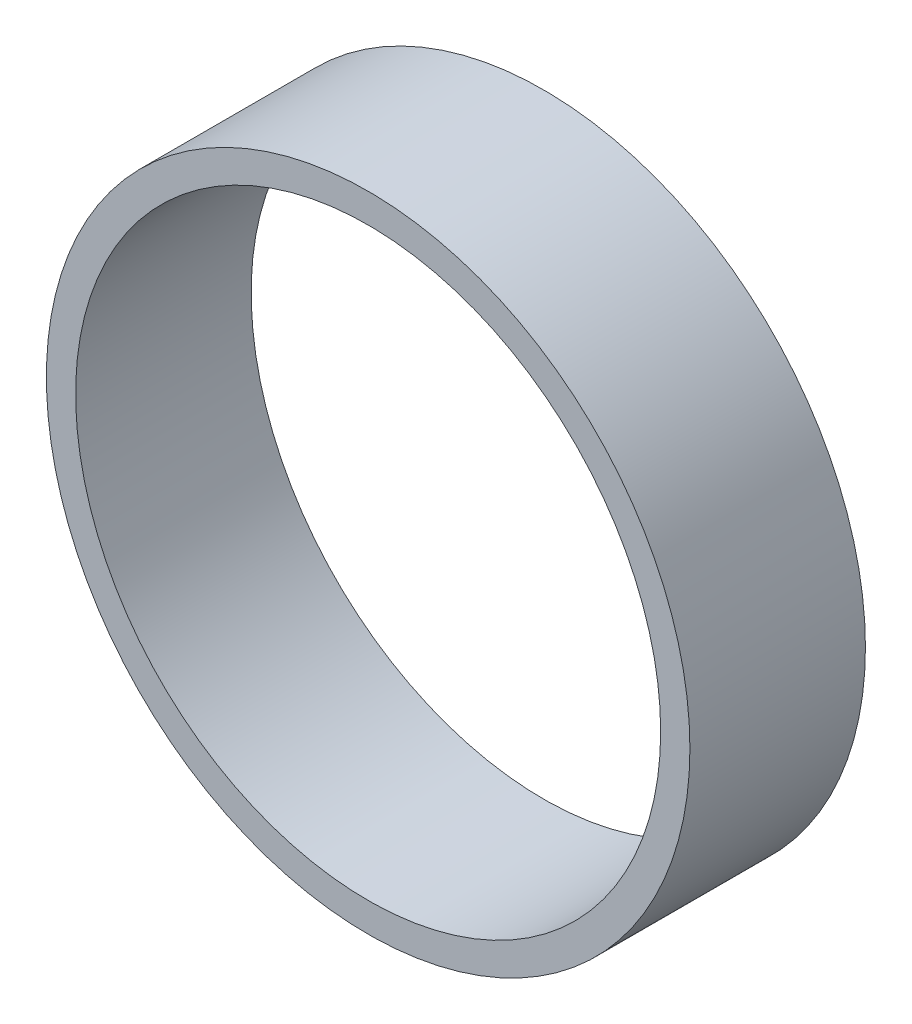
from build123d import *

# Parameters (mm, degrees)
ESQUISSE1_R      = 27.5
ESQUISSE1_R_2    = 25
EXTRUSION1_DEPTH = 15


with BuildPart() as part:
    # Esquisse1 → Extrusion1 (new body)
    with BuildSketch(Plane.XY):
        Circle(ESQUISSE1_R)
        Circle(ESQUISSE1_R_2, mode=Mode.SUBTRACT)
    extrude(amount=EXTRUSION1_DEPTH)


solid = part.part
